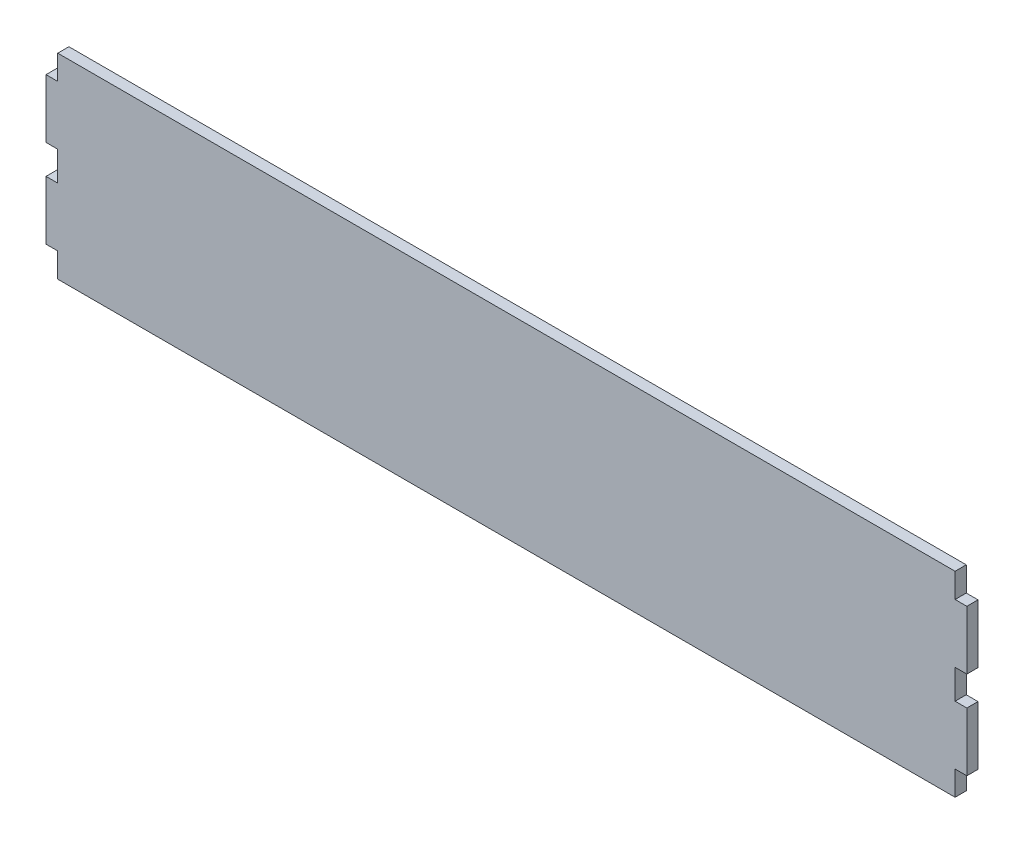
from build123d import *

# Parameters (mm, degrees)
CROQUIS1_W              = 458.4
CROQUIS1_H              = 100
SALIENTE_EXTRUIR1_DEPTH = 5.7
CROQUIS2_W              = 5.7
CROQUIS2_H              = 30
SALIENTE_EXTRUIR2_DEPTH = 6
CROQUIS3_W              = 5.7
CROQUIS3_H              = 30
SALIENTE_EXTRUIR3_DEPTH = 6


with BuildPart() as part:
    # Croquis1 → Saliente-Extruir1 (new body)
    with BuildSketch(Plane.XY):
        Rectangle(CROQUIS1_W, CROQUIS1_H)
    extrude(amount=SALIENTE_EXTRUIR1_DEPTH)

    # Croquis2 → Saliente-Extruir2 (add)
    with BuildSketch(Plane.ZY.offset(229.2)):
        with Locations((2.85, -22.5)):
            Rectangle(CROQUIS2_W, CROQUIS2_H)
        with Locations((2.85, 22.5)):
            Rectangle(CROQUIS2_W, CROQUIS2_H)
    extrude(amount=SALIENTE_EXTRUIR2_DEPTH)

    # Croquis3 → Saliente-Extruir3 (add)
    with BuildSketch(Plane(origin=(229.2, 0, 0), x_dir=(0, 0, -1), z_dir=(1, 0, 0))):
        with Locations((-2.85, 22.5)):
            Rectangle(CROQUIS3_W, CROQUIS3_H)
        with Locations((-2.85, -22.5)):
            Rectangle(CROQUIS3_W, CROQUIS3_H)
    extrude(amount=SALIENTE_EXTRUIR3_DEPTH)


solid = part.part
